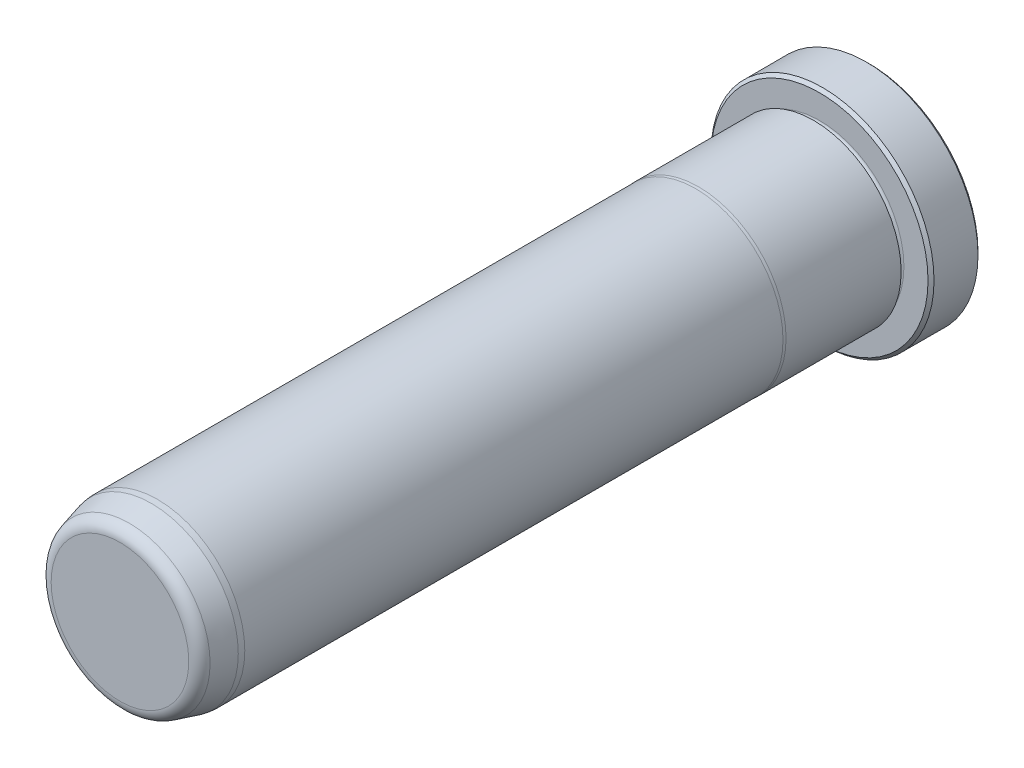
from build123d import *

# Parameters (mm, degrees)
FILLET6_R     = 1.5875
CHAMFER1_SIZE = 0.381


with BuildPart() as part:
    # Sketch1 → Revolve1 (revolve)
    with BuildSketch(Plane(origin=(0, 0, 0), x_dir=(0, 0, -1), z_dir=(1, 0, 0)), mode=Mode.PRIVATE) as revolve1_sk:
        with BuildLine():
            Line((0, 0), (0, 14.1605))
            Line((0, 14.1605), (-6.35, 14.1605))
            Line((-6.35, 14.1605), (-6.35, 10.7188))
            ThreePointArc((-6.35, 10.7188), (-6.731, 10.3378), (-7.112, 10.7188))
            Line((-7.112, 10.7188), (-7.112, 11.1252))
            Line((-7.112, 11.1252), (-21.734763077, 11.1252))
            Line((-21.734763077, 11.1252), (-22.098, 11.0998))
            Line((-22.098, 11.0998), (-90.4875, 11.0998))
            Line((-90.4875, 11.0998), (-91.2495, 11.033133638))
            Line((-91.2495, 11.033133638), (-95.25, 9.961202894))
            Line((-95.25, 9.961202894), (-95.25, 0))
            Line((-95.25, 0), (0, 0))
        make_face()
    revolve(revolve1_sk.sketch.rotate(Axis((0, 0, 0), (0, 0, -1)), 90), axis=Axis((0, 0, 0), (0, 0, -1)))

    # Fillet6
    fillet6_edges = [part.edges().sort_by_distance(p)[0] for p in [
        (-9.961202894, 0, 95.25),
    ]]
    fillet(fillet6_edges, radius=FILLET6_R)

    # Chamfer1
    chamfer1_edges = [part.edges().sort_by_distance(p)[0] for p in [
        (-14.1605, 0, 6.35),
        (-14.1605, 0, 0),
    ]]
    chamfer(chamfer1_edges, length=CHAMFER1_SIZE)


solid = part.part
